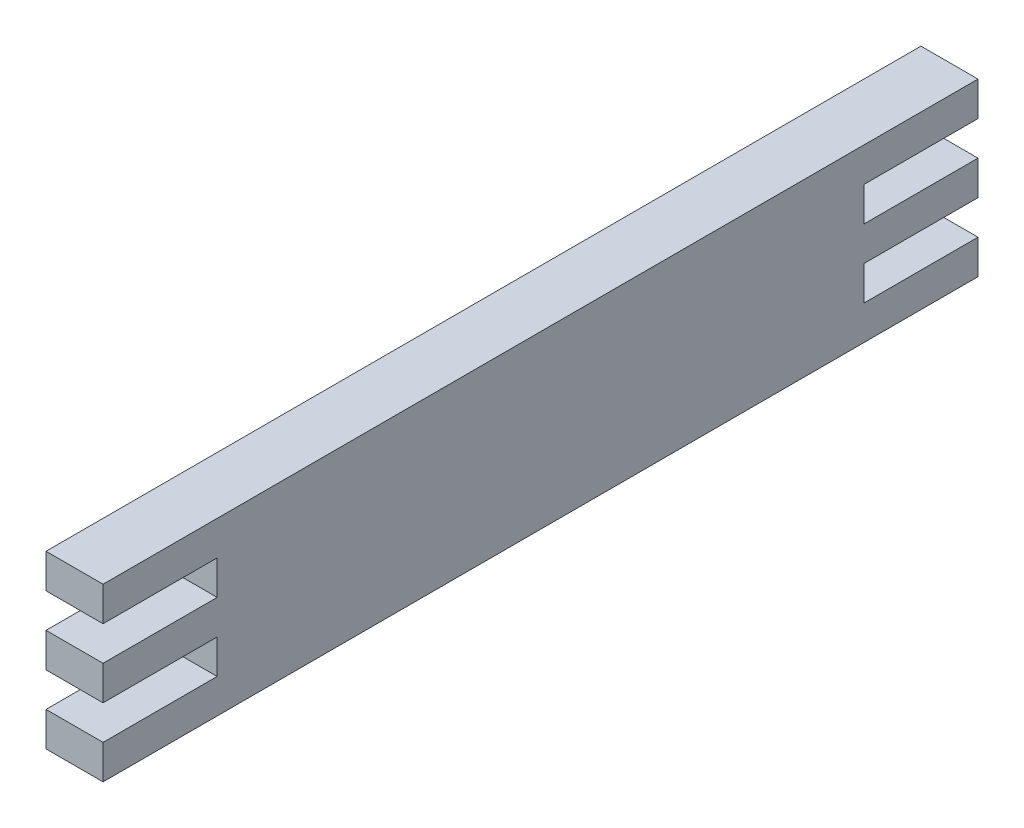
ISO-10303-21;
HEADER;
FILE_DESCRIPTION(('STEP AP214'),'2;1');
FILE_NAME('part.step','',(''),(''),'','','');
FILE_SCHEMA(('AUTOMOTIVE_DESIGN { 1 0 10303 214 1 1 1 1 }'));
ENDSEC;
DATA;
#1=APPLICATION_CONTEXT('core data for automotive mechanical design processes');
#2=APPLICATION_PROTOCOL_DEFINITION('international standard','automotive_design',2000,#1);
#3=PRODUCT_CONTEXT('',#1,'mechanical');
#4=PRODUCT('Part','Part','',(#3));
#5=PRODUCT_RELATED_PRODUCT_CATEGORY('part','',(#4));
#6=PRODUCT_DEFINITION_FORMATION('','',#4);
#7=PRODUCT_DEFINITION_CONTEXT('part definition',#1,'design');
#8=PRODUCT_DEFINITION('design','',#6,#7);
#9=PRODUCT_DEFINITION_SHAPE('','',#8);
#10=(LENGTH_UNIT() NAMED_UNIT(*) SI_UNIT(.MILLI.,.METRE.));
#11=(NAMED_UNIT(*) PLANE_ANGLE_UNIT() SI_UNIT($,.RADIAN.));
#12=(NAMED_UNIT(*) SI_UNIT($,.STERADIAN.) SOLID_ANGLE_UNIT());
#13=UNCERTAINTY_MEASURE_WITH_UNIT(LENGTH_MEASURE(1.E-05),#10,'distance_accuracy_value','');
#14=(GEOMETRIC_REPRESENTATION_CONTEXT(3) GLOBAL_UNCERTAINTY_ASSIGNED_CONTEXT((#13)) GLOBAL_UNIT_ASSIGNED_CONTEXT((#10,
#11,#12)) REPRESENTATION_CONTEXT('',''));
#15=CARTESIAN_POINT('',(0.,0.,0.));
#16=DIRECTION('',(0.,0.,1.));
#17=DIRECTION('',(1.,0.,0.));
#18=AXIS2_PLACEMENT_3D('',#15,#16,#17);
#19=CARTESIAN_POINT('',(3.,-4.5,-23.));
#20=DIRECTION('',(0.,0.,1.));
#21=DIRECTION('',(1.,0.,0.));
#22=AXIS2_PLACEMENT_3D('',#19,#20,#21);
#23=PLANE('',#22);
#24=DIRECTION('',(0.,1.,0.));
#25=VECTOR('',#24,1.);
#26=CARTESIAN_POINT('',(0.,-4.5,-23.));
#27=LINE('',#26,#25);
#28=CARTESIAN_POINT('',(0.,-0.9,-23.));
#29=VERTEX_POINT('',#28);
#30=CARTESIAN_POINT('',(0.,0.9,-23.));
#31=VERTEX_POINT('',#30);
#32=EDGE_CURVE('E216',#29,#31,#27,.T.);
#33=ORIENTED_EDGE('',*,*,#32,.T.);
#34=DIRECTION('',(1.,0.,0.));
#35=VECTOR('',#34,1.);
#36=CARTESIAN_POINT('',(-7.,0.9,-23.));
#37=LINE('',#36,#35);
#38=CARTESIAN_POINT('',(3.,0.9,-23.));
#39=VERTEX_POINT('',#38);
#40=EDGE_CURVE('E317',#31,#39,#37,.T.);
#41=ORIENTED_EDGE('',*,*,#40,.T.);
#42=DIRECTION('',(0.,1.,0.));
#43=VECTOR('',#42,1.);
#44=CARTESIAN_POINT('',(3.,-4.5,-23.));
#45=LINE('',#44,#43);
#46=CARTESIAN_POINT('',(3.,-0.9,-23.));
#47=VERTEX_POINT('',#46);
#48=EDGE_CURVE('E190',#47,#39,#45,.T.);
#49=ORIENTED_EDGE('',*,*,#48,.F.);
#50=DIRECTION('',(1.,0.,0.));
#51=VECTOR('',#50,1.);
#52=CARTESIAN_POINT('',(-7.,-0.9,-23.));
#53=LINE('',#52,#51);
#54=EDGE_CURVE('E308',#29,#47,#53,.T.);
#55=ORIENTED_EDGE('',*,*,#54,.F.);
#56=EDGE_LOOP('',(#33,#41,#49,#55));
#57=FACE_BOUND('',#56,.T.);
#58=ADVANCED_FACE('F31',(#57),#23,.F.);
#59=CARTESIAN_POINT('',(3.,2.7,-23.));
#60=VERTEX_POINT('',#59);
#61=CARTESIAN_POINT('',(3.,4.5,-23.));
#62=VERTEX_POINT('',#61);
#63=EDGE_CURVE('E180',#60,#62,#45,.T.);
#64=ORIENTED_EDGE('',*,*,#63,.F.);
#65=DIRECTION('',(1.,0.,0.));
#66=VECTOR('',#65,1.);
#67=CARTESIAN_POINT('',(-7.,2.7,-23.));
#68=LINE('',#67,#66);
#69=CARTESIAN_POINT('',(0.,2.7,-23.));
#70=VERTEX_POINT('',#69);
#71=EDGE_CURVE('E165',#70,#60,#68,.T.);
#72=ORIENTED_EDGE('',*,*,#71,.F.);
#73=CARTESIAN_POINT('',(0.,4.5,-23.));
#74=VERTEX_POINT('',#73);
#75=EDGE_CURVE('E217',#70,#74,#27,.T.);
#76=ORIENTED_EDGE('',*,*,#75,.T.);
#77=DIRECTION('',(-1.,0.,0.));
#78=VECTOR('',#77,1.);
#79=CARTESIAN_POINT('',(3.,4.5,-23.));
#80=LINE('',#79,#78);
#81=EDGE_CURVE('E189',#62,#74,#80,.T.);
#82=ORIENTED_EDGE('',*,*,#81,.F.);
#83=EDGE_LOOP('',(#64,#72,#76,#82));
#84=FACE_BOUND('',#83,.T.);
#85=ADVANCED_FACE('F187',(#84),#23,.F.);
#86=CARTESIAN_POINT('',(3.,-4.5,23.));
#87=DIRECTION('',(0.,0.,-1.));
#88=DIRECTION('',(-1.,0.,0.));
#89=AXIS2_PLACEMENT_3D('',#86,#87,#88);
#90=PLANE('',#89);
#91=DIRECTION('',(0.,-1.,0.));
#92=VECTOR('',#91,1.);
#93=CARTESIAN_POINT('',(3.,-4.5,23.));
#94=LINE('',#93,#92);
#95=CARTESIAN_POINT('',(3.,-2.7,23.));
#96=VERTEX_POINT('',#95);
#97=CARTESIAN_POINT('',(3.,-4.5,23.));
#98=VERTEX_POINT('',#97);
#99=EDGE_CURVE('E202',#96,#98,#94,.T.);
#100=ORIENTED_EDGE('',*,*,#99,.F.);
#101=DIRECTION('',(1.,0.,0.));
#102=VECTOR('',#101,1.);
#103=CARTESIAN_POINT('',(-7.,-2.7,23.));
#104=LINE('',#103,#102);
#105=CARTESIAN_POINT('',(0.,-2.7,23.));
#106=VERTEX_POINT('',#105);
#107=EDGE_CURVE('E293',#106,#96,#104,.T.);
#108=ORIENTED_EDGE('',*,*,#107,.F.);
#109=DIRECTION('',(0.,-1.,0.));
#110=VECTOR('',#109,1.);
#111=CARTESIAN_POINT('',(0.,-4.5,23.));
#112=LINE('',#111,#110);
#113=CARTESIAN_POINT('',(0.,-4.5,23.));
#114=VERTEX_POINT('',#113);
#115=EDGE_CURVE('E219',#106,#114,#112,.T.);
#116=ORIENTED_EDGE('',*,*,#115,.T.);
#117=DIRECTION('',(-1.,0.,0.));
#118=VECTOR('',#117,1.);
#119=CARTESIAN_POINT('',(3.,-4.5,23.));
#120=LINE('',#119,#118);
#121=EDGE_CURVE('E225',#98,#114,#120,.T.);
#122=ORIENTED_EDGE('',*,*,#121,.F.);
#123=EDGE_LOOP('',(#100,#108,#116,#122));
#124=FACE_BOUND('',#123,.T.);
#125=ADVANCED_FACE('F386',(#124),#90,.F.);
#126=CARTESIAN_POINT('',(0.,0.9,23.));
#127=VERTEX_POINT('',#126);
#128=CARTESIAN_POINT('',(0.,-0.900000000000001,23.));
#129=VERTEX_POINT('',#128);
#130=EDGE_CURVE('E221',#127,#129,#112,.T.);
#131=ORIENTED_EDGE('',*,*,#130,.T.);
#132=DIRECTION('',(1.,0.,0.));
#133=VECTOR('',#132,1.);
#134=CARTESIAN_POINT('',(-7.,-0.900000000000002,23.));
#135=LINE('',#134,#133);
#136=CARTESIAN_POINT('',(3.,-0.900000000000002,23.));
#137=VERTEX_POINT('',#136);
#138=EDGE_CURVE('E289',#129,#137,#135,.T.);
#139=ORIENTED_EDGE('',*,*,#138,.T.);
#140=CARTESIAN_POINT('',(3.,0.9,23.));
#141=VERTEX_POINT('',#140);
#142=EDGE_CURVE('E205',#141,#137,#94,.T.);
#143=ORIENTED_EDGE('',*,*,#142,.F.);
#144=DIRECTION('',(1.,0.,0.));
#145=VECTOR('',#144,1.);
#146=CARTESIAN_POINT('',(-7.,0.9,23.));
#147=LINE('',#146,#145);
#148=EDGE_CURVE('E262',#127,#141,#147,.T.);
#149=ORIENTED_EDGE('',*,*,#148,.F.);
#150=EDGE_LOOP('',(#131,#139,#143,#149));
#151=FACE_BOUND('',#150,.T.);
#152=ADVANCED_FACE('F358',(#151),#90,.F.);
#153=CARTESIAN_POINT('',(0.,-4.5,-23.));
#154=VERTEX_POINT('',#153);
#155=CARTESIAN_POINT('',(0.,-2.7,-23.));
#156=VERTEX_POINT('',#155);
#157=EDGE_CURVE('E212',#154,#156,#27,.T.);
#158=ORIENTED_EDGE('',*,*,#157,.T.);
#159=DIRECTION('',(1.,0.,0.));
#160=VECTOR('',#159,1.);
#161=CARTESIAN_POINT('',(-7.,-2.7,-23.));
#162=LINE('',#161,#160);
#163=CARTESIAN_POINT('',(3.,-2.7,-23.));
#164=VERTEX_POINT('',#163);
#165=EDGE_CURVE('E54',#156,#164,#162,.T.);
#166=ORIENTED_EDGE('',*,*,#165,.T.);
#167=CARTESIAN_POINT('',(3.,-4.5,-23.));
#168=VERTEX_POINT('',#167);
#169=EDGE_CURVE('E193',#168,#164,#45,.T.);
#170=ORIENTED_EDGE('',*,*,#169,.F.);
#171=DIRECTION('',(-1.,0.,0.));
#172=VECTOR('',#171,1.);
#173=CARTESIAN_POINT('',(3.,-4.5,-23.));
#174=LINE('',#173,#172);
#175=EDGE_CURVE('E211',#168,#154,#174,.T.);
#176=ORIENTED_EDGE('',*,*,#175,.T.);
#177=EDGE_LOOP('',(#158,#166,#170,#176));
#178=FACE_BOUND('',#177,.T.);
#179=ADVANCED_FACE('F33',(#178),#23,.F.);
#180=CARTESIAN_POINT('',(3.,4.5,23.));
#181=DIRECTION('',(0.,-1.,0.));
#182=DIRECTION('',(0.,0.,-1.));
#183=AXIS2_PLACEMENT_3D('',#180,#181,#182);
#184=PLANE('',#183);
#185=DIRECTION('',(0.,0.,1.));
#186=VECTOR('',#185,1.);
#187=CARTESIAN_POINT('',(0.,4.5,23.));
#188=LINE('',#187,#186);
#189=CARTESIAN_POINT('',(0.,4.5,23.));
#190=VERTEX_POINT('',#189);
#191=EDGE_CURVE('E215',#74,#190,#188,.T.);
#192=ORIENTED_EDGE('',*,*,#191,.T.);
#193=DIRECTION('',(-1.,0.,0.));
#194=VECTOR('',#193,1.);
#195=CARTESIAN_POINT('',(3.,4.5,23.));
#196=LINE('',#195,#194);
#197=CARTESIAN_POINT('',(3.,4.5,23.));
#198=VERTEX_POINT('',#197);
#199=EDGE_CURVE('E228',#198,#190,#196,.T.);
#200=ORIENTED_EDGE('',*,*,#199,.F.);
#201=DIRECTION('',(0.,0.,1.));
#202=VECTOR('',#201,1.);
#203=CARTESIAN_POINT('',(3.,4.5,23.));
#204=LINE('',#203,#202);
#205=EDGE_CURVE('E199',#62,#198,#204,.T.);
#206=ORIENTED_EDGE('',*,*,#205,.F.);
#207=ORIENTED_EDGE('',*,*,#81,.T.);
#208=EDGE_LOOP('',(#192,#200,#206,#207));
#209=FACE_BOUND('',#208,.T.);
#210=ADVANCED_FACE('F379',(#209),#184,.F.);
#211=CARTESIAN_POINT('',(0.,2.7,23.));
#212=VERTEX_POINT('',#211);
#213=EDGE_CURVE('E194',#190,#212,#112,.T.);
#214=ORIENTED_EDGE('',*,*,#213,.T.);
#215=DIRECTION('',(1.,0.,0.));
#216=VECTOR('',#215,1.);
#217=CARTESIAN_POINT('',(-7.,2.7,23.));
#218=LINE('',#217,#216);
#219=CARTESIAN_POINT('',(3.,2.7,23.));
#220=VERTEX_POINT('',#219);
#221=EDGE_CURVE('E268',#212,#220,#218,.T.);
#222=ORIENTED_EDGE('',*,*,#221,.T.);
#223=EDGE_CURVE('E207',#198,#220,#94,.T.);
#224=ORIENTED_EDGE('',*,*,#223,.F.);
#225=ORIENTED_EDGE('',*,*,#199,.T.);
#226=EDGE_LOOP('',(#214,#222,#224,#225));
#227=FACE_BOUND('',#226,.T.);
#228=ADVANCED_FACE('F376',(#227),#90,.F.);
#229=CARTESIAN_POINT('',(3.,-4.5,23.));
#230=DIRECTION('',(0.,1.,0.));
#231=DIRECTION('',(0.,0.,1.));
#232=AXIS2_PLACEMENT_3D('',#229,#230,#231);
#233=PLANE('',#232);
#234=DIRECTION('',(0.,0.,-1.));
#235=VECTOR('',#234,1.);
#236=CARTESIAN_POINT('',(0.,-4.5,23.));
#237=LINE('',#236,#235);
#238=EDGE_CURVE('E191',#114,#154,#237,.T.);
#239=ORIENTED_EDGE('',*,*,#238,.T.);
#240=ORIENTED_EDGE('',*,*,#175,.F.);
#241=DIRECTION('',(0.,0.,-1.));
#242=VECTOR('',#241,1.);
#243=CARTESIAN_POINT('',(3.,-4.5,23.));
#244=LINE('',#243,#242);
#245=EDGE_CURVE('E209',#98,#168,#244,.T.);
#246=ORIENTED_EDGE('',*,*,#245,.F.);
#247=ORIENTED_EDGE('',*,*,#121,.T.);
#248=EDGE_LOOP('',(#239,#240,#246,#247));
#249=FACE_BOUND('',#248,.T.);
#250=ADVANCED_FACE('F347',(#249),#233,.F.);
#251=CARTESIAN_POINT('',(3.,4.5,-23.));
#252=DIRECTION('',(-1.,0.,0.));
#253=DIRECTION('',(0.,0.,1.));
#254=AXIS2_PLACEMENT_3D('',#251,#252,#253);
#255=PLANE('',#254);
#256=ORIENTED_EDGE('',*,*,#48,.T.);
#257=DIRECTION('',(0.,0.,-1.));
#258=VECTOR('',#257,1.);
#259=CARTESIAN_POINT('',(3.,0.9,-23.));
#260=LINE('',#259,#258);
#261=CARTESIAN_POINT('',(3.,0.9,-17.));
#262=VERTEX_POINT('',#261);
#263=EDGE_CURVE('E175',#262,#39,#260,.T.);
#264=ORIENTED_EDGE('',*,*,#263,.F.);
#265=DIRECTION('',(0.,-1.,0.));
#266=VECTOR('',#265,1.);
#267=CARTESIAN_POINT('',(3.,0.9,-17.));
#268=LINE('',#267,#266);
#269=CARTESIAN_POINT('',(3.,2.7,-17.));
#270=VERTEX_POINT('',#269);
#271=EDGE_CURVE('E184',#270,#262,#268,.T.);
#272=ORIENTED_EDGE('',*,*,#271,.F.);
#273=DIRECTION('',(0.,0.,1.));
#274=VECTOR('',#273,1.);
#275=CARTESIAN_POINT('',(3.,2.7,-23.));
#276=LINE('',#275,#274);
#277=EDGE_CURVE('E168',#60,#270,#276,.T.);
#278=ORIENTED_EDGE('',*,*,#277,.F.);
#279=ORIENTED_EDGE('',*,*,#63,.T.);
#280=ORIENTED_EDGE('',*,*,#205,.T.);
#281=ORIENTED_EDGE('',*,*,#223,.T.);
#282=DIRECTION('',(0.,0.,1.));
#283=VECTOR('',#282,1.);
#284=CARTESIAN_POINT('',(3.,2.7,17.));
#285=LINE('',#284,#283);
#286=CARTESIAN_POINT('',(3.,2.7,17.));
#287=VERTEX_POINT('',#286);
#288=EDGE_CURVE('E278',#287,#220,#285,.T.);
#289=ORIENTED_EDGE('',*,*,#288,.F.);
#290=DIRECTION('',(0.,1.,0.));
#291=VECTOR('',#290,1.);
#292=CARTESIAN_POINT('',(3.,2.7,17.));
#293=LINE('',#292,#291);
#294=CARTESIAN_POINT('',(3.,0.9,17.));
#295=VERTEX_POINT('',#294);
#296=EDGE_CURVE('E282',#295,#287,#293,.T.);
#297=ORIENTED_EDGE('',*,*,#296,.F.);
#298=DIRECTION('',(0.,0.,-1.));
#299=VECTOR('',#298,1.);
#300=CARTESIAN_POINT('',(3.,0.9,17.));
#301=LINE('',#300,#299);
#302=EDGE_CURVE('E271',#141,#295,#301,.T.);
#303=ORIENTED_EDGE('',*,*,#302,.F.);
#304=ORIENTED_EDGE('',*,*,#142,.T.);
#305=DIRECTION('',(0.,0.,1.));
#306=VECTOR('',#305,1.);
#307=CARTESIAN_POINT('',(3.,-0.900000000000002,17.));
#308=LINE('',#307,#306);
#309=CARTESIAN_POINT('',(3.,-0.900000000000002,17.));
#310=VERTEX_POINT('',#309);
#311=EDGE_CURVE('E298',#310,#137,#308,.T.);
#312=ORIENTED_EDGE('',*,*,#311,.F.);
#313=DIRECTION('',(0.,1.,0.));
#314=VECTOR('',#313,1.);
#315=CARTESIAN_POINT('',(3.,-0.900000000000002,17.));
#316=LINE('',#315,#314);
#317=CARTESIAN_POINT('',(3.,-2.7,17.));
#318=VERTEX_POINT('',#317);
#319=EDGE_CURVE('E300',#318,#310,#316,.T.);
#320=ORIENTED_EDGE('',*,*,#319,.F.);
#321=DIRECTION('',(0.,0.,-1.));
#322=VECTOR('',#321,1.);
#323=CARTESIAN_POINT('',(3.,-2.7,17.));
#324=LINE('',#323,#322);
#325=EDGE_CURVE('E290',#96,#318,#324,.T.);
#326=ORIENTED_EDGE('',*,*,#325,.F.);
#327=ORIENTED_EDGE('',*,*,#99,.T.);
#328=ORIENTED_EDGE('',*,*,#245,.T.);
#329=ORIENTED_EDGE('',*,*,#169,.T.);
#330=DIRECTION('',(0.,0.,-1.));
#331=VECTOR('',#330,1.);
#332=CARTESIAN_POINT('',(3.,-2.7,-17.));
#333=LINE('',#332,#331);
#334=CARTESIAN_POINT('',(3.,-2.7,-17.));
#335=VERTEX_POINT('',#334);
#336=EDGE_CURVE('E313',#335,#164,#333,.T.);
#337=ORIENTED_EDGE('',*,*,#336,.F.);
#338=DIRECTION('',(0.,-1.,0.));
#339=VECTOR('',#338,1.);
#340=CARTESIAN_POINT('',(3.,-0.9,-17.));
#341=LINE('',#340,#339);
#342=CARTESIAN_POINT('',(3.,-0.9,-17.));
#343=VERTEX_POINT('',#342);
#344=EDGE_CURVE('E315',#343,#335,#341,.T.);
#345=ORIENTED_EDGE('',*,*,#344,.F.);
#346=DIRECTION('',(0.,0.,1.));
#347=VECTOR('',#346,1.);
#348=CARTESIAN_POINT('',(3.,-0.9,-17.));
#349=LINE('',#348,#347);
#350=EDGE_CURVE('E306',#47,#343,#349,.T.);
#351=ORIENTED_EDGE('',*,*,#350,.F.);
#352=EDGE_LOOP('',(#256,#264,#272,#278,#279,#280,#281,#289,#297,#303,#304,#312,#320,#326,#327,
#328,#329,#337,#345,#351));
#353=FACE_BOUND('',#352,.T.);
#354=ADVANCED_FACE('F179',(#353),#255,.F.);
#355=CARTESIAN_POINT('',(0.,4.5,-23.));
#356=DIRECTION('',(-1.,0.,0.));
#357=DIRECTION('',(0.,0.,1.));
#358=AXIS2_PLACEMENT_3D('',#355,#356,#357);
#359=PLANE('',#358);
#360=DIRECTION('',(0.,0.,1.));
#361=VECTOR('',#360,1.);
#362=CARTESIAN_POINT('',(0.,0.9,-23.));
#363=LINE('',#362,#361);
#364=CARTESIAN_POINT('',(0.,0.9,-17.));
#365=VERTEX_POINT('',#364);
#366=EDGE_CURVE('E11',#31,#365,#363,.T.);
#367=ORIENTED_EDGE('',*,*,#366,.F.);
#368=ORIENTED_EDGE('',*,*,#32,.F.);
#369=DIRECTION('',(0.,0.,-1.));
#370=VECTOR('',#369,1.);
#371=CARTESIAN_POINT('',(0.,-0.9,-23.));
#372=LINE('',#371,#370);
#373=CARTESIAN_POINT('',(0.,-0.9,-17.));
#374=VERTEX_POINT('',#373);
#375=EDGE_CURVE('E248',#374,#29,#372,.T.);
#376=ORIENTED_EDGE('',*,*,#375,.F.);
#377=DIRECTION('',(0.,1.,0.));
#378=VECTOR('',#377,1.);
#379=CARTESIAN_POINT('',(0.,4.5,-17.));
#380=LINE('',#379,#378);
#381=CARTESIAN_POINT('',(0.,-2.7,-17.));
#382=VERTEX_POINT('',#381);
#383=EDGE_CURVE('E246',#382,#374,#380,.T.);
#384=ORIENTED_EDGE('',*,*,#383,.F.);
#385=DIRECTION('',(0.,0.,1.));
#386=VECTOR('',#385,1.);
#387=CARTESIAN_POINT('',(0.,-2.7,-23.));
#388=LINE('',#387,#386);
#389=EDGE_CURVE('E244',#156,#382,#388,.T.);
#390=ORIENTED_EDGE('',*,*,#389,.F.);
#391=ORIENTED_EDGE('',*,*,#157,.F.);
#392=ORIENTED_EDGE('',*,*,#238,.F.);
#393=ORIENTED_EDGE('',*,*,#115,.F.);
#394=DIRECTION('',(0.,0.,1.));
#395=VECTOR('',#394,1.);
#396=CARTESIAN_POINT('',(0.,-2.7,-23.));
#397=LINE('',#396,#395);
#398=CARTESIAN_POINT('',(0.,-2.7,17.));
#399=VERTEX_POINT('',#398);
#400=EDGE_CURVE('E242',#399,#106,#397,.T.);
#401=ORIENTED_EDGE('',*,*,#400,.F.);
#402=DIRECTION('',(0.,-1.,0.));
#403=VECTOR('',#402,1.);
#404=CARTESIAN_POINT('',(0.,4.5,17.));
#405=LINE('',#404,#403);
#406=CARTESIAN_POINT('',(0.,-0.900000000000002,17.));
#407=VERTEX_POINT('',#406);
#408=EDGE_CURVE('E240',#407,#399,#405,.T.);
#409=ORIENTED_EDGE('',*,*,#408,.F.);
#410=DIRECTION('',(0.,0.,-1.));
#411=VECTOR('',#410,1.);
#412=CARTESIAN_POINT('',(0.,-0.900000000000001,-23.));
#413=LINE('',#412,#411);
#414=EDGE_CURVE('E238',#129,#407,#413,.T.);
#415=ORIENTED_EDGE('',*,*,#414,.F.);
#416=ORIENTED_EDGE('',*,*,#130,.F.);
#417=DIRECTION('',(0.,0.,1.));
#418=VECTOR('',#417,1.);
#419=CARTESIAN_POINT('',(0.,0.9,-23.));
#420=LINE('',#419,#418);
#421=CARTESIAN_POINT('',(0.,0.9,17.));
#422=VERTEX_POINT('',#421);
#423=EDGE_CURVE('E236',#422,#127,#420,.T.);
#424=ORIENTED_EDGE('',*,*,#423,.F.);
#425=DIRECTION('',(0.,-1.,0.));
#426=VECTOR('',#425,1.);
#427=CARTESIAN_POINT('',(0.,4.5,17.));
#428=LINE('',#427,#426);
#429=CARTESIAN_POINT('',(0.,2.7,17.));
#430=VERTEX_POINT('',#429);
#431=EDGE_CURVE('E234',#430,#422,#428,.T.);
#432=ORIENTED_EDGE('',*,*,#431,.F.);
#433=DIRECTION('',(0.,0.,-1.));
#434=VECTOR('',#433,1.);
#435=CARTESIAN_POINT('',(0.,2.7,-23.));
#436=LINE('',#435,#434);
#437=EDGE_CURVE('E232',#212,#430,#436,.T.);
#438=ORIENTED_EDGE('',*,*,#437,.F.);
#439=ORIENTED_EDGE('',*,*,#213,.F.);
#440=ORIENTED_EDGE('',*,*,#191,.F.);
#441=ORIENTED_EDGE('',*,*,#75,.F.);
#442=DIRECTION('',(0.,0.,-1.));
#443=VECTOR('',#442,1.);
#444=CARTESIAN_POINT('',(0.,2.7,-23.));
#445=LINE('',#444,#443);
#446=CARTESIAN_POINT('',(0.,2.7,-17.));
#447=VERTEX_POINT('',#446);
#448=EDGE_CURVE('E171',#447,#70,#445,.T.);
#449=ORIENTED_EDGE('',*,*,#448,.F.);
#450=DIRECTION('',(0.,1.,0.));
#451=VECTOR('',#450,1.);
#452=CARTESIAN_POINT('',(0.,4.5,-17.));
#453=LINE('',#452,#451);
#454=EDGE_CURVE('E39',#365,#447,#453,.T.);
#455=ORIENTED_EDGE('',*,*,#454,.F.);
#456=EDGE_LOOP('',(#367,#368,#376,#384,#390,#391,#392,#393,#401,#409,#415,#416,#424,#432,#438,
#439,#440,#441,#449,#455));
#457=FACE_BOUND('',#456,.T.);
#458=ADVANCED_FACE('F257',(#457),#359,.T.);
#459=CARTESIAN_POINT('',(-7.,2.7,17.));
#460=DIRECTION('',(0.,0.,-1.));
#461=DIRECTION('',(-1.,0.,0.));
#462=AXIS2_PLACEMENT_3D('',#459,#460,#461);
#463=PLANE('',#462);
#464=ORIENTED_EDGE('',*,*,#431,.T.);
#465=DIRECTION('',(1.,0.,0.));
#466=VECTOR('',#465,1.);
#467=CARTESIAN_POINT('',(-7.,0.9,17.));
#468=LINE('',#467,#466);
#469=EDGE_CURVE('E260',#422,#295,#468,.T.);
#470=ORIENTED_EDGE('',*,*,#469,.T.);
#471=ORIENTED_EDGE('',*,*,#296,.T.);
#472=DIRECTION('',(1.,0.,0.));
#473=VECTOR('',#472,1.);
#474=CARTESIAN_POINT('',(-7.,2.7,17.));
#475=LINE('',#474,#473);
#476=EDGE_CURVE('E275',#430,#287,#475,.T.);
#477=ORIENTED_EDGE('',*,*,#476,.F.);
#478=EDGE_LOOP('',(#464,#470,#471,#477));
#479=FACE_BOUND('',#478,.T.);
#480=ADVANCED_FACE('F373',(#479),#463,.F.);
#481=CARTESIAN_POINT('',(-7.,0.9,17.));
#482=DIRECTION('',(0.,-1.,0.));
#483=DIRECTION('',(0.,0.,-1.));
#484=AXIS2_PLACEMENT_3D('',#481,#482,#483);
#485=PLANE('',#484);
#486=ORIENTED_EDGE('',*,*,#423,.T.);
#487=ORIENTED_EDGE('',*,*,#148,.T.);
#488=ORIENTED_EDGE('',*,*,#302,.T.);
#489=ORIENTED_EDGE('',*,*,#469,.F.);
#490=EDGE_LOOP('',(#486,#487,#488,#489));
#491=FACE_BOUND('',#490,.T.);
#492=ADVANCED_FACE('F407',(#491),#485,.F.);
#493=CARTESIAN_POINT('',(-7.,2.7,17.));
#494=DIRECTION('',(0.,1.,0.));
#495=DIRECTION('',(0.,0.,1.));
#496=AXIS2_PLACEMENT_3D('',#493,#494,#495);
#497=PLANE('',#496);
#498=ORIENTED_EDGE('',*,*,#437,.T.);
#499=ORIENTED_EDGE('',*,*,#476,.T.);
#500=ORIENTED_EDGE('',*,*,#288,.T.);
#501=ORIENTED_EDGE('',*,*,#221,.F.);
#502=EDGE_LOOP('',(#498,#499,#500,#501));
#503=FACE_BOUND('',#502,.T.);
#504=ADVANCED_FACE('F408',(#503),#497,.F.);
#505=CARTESIAN_POINT('',(-7.,-0.900000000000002,17.));
#506=DIRECTION('',(0.,0.,-1.));
#507=DIRECTION('',(-1.,0.,0.));
#508=AXIS2_PLACEMENT_3D('',#505,#506,#507);
#509=PLANE('',#508);
#510=ORIENTED_EDGE('',*,*,#408,.T.);
#511=DIRECTION('',(1.,0.,0.));
#512=VECTOR('',#511,1.);
#513=CARTESIAN_POINT('',(-7.,-2.7,17.));
#514=LINE('',#513,#512);
#515=EDGE_CURVE('E284',#399,#318,#514,.T.);
#516=ORIENTED_EDGE('',*,*,#515,.T.);
#517=ORIENTED_EDGE('',*,*,#319,.T.);
#518=DIRECTION('',(1.,0.,0.));
#519=VECTOR('',#518,1.);
#520=CARTESIAN_POINT('',(-7.,-0.900000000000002,17.));
#521=LINE('',#520,#519);
#522=EDGE_CURVE('E287',#407,#310,#521,.T.);
#523=ORIENTED_EDGE('',*,*,#522,.F.);
#524=EDGE_LOOP('',(#510,#516,#517,#523));
#525=FACE_BOUND('',#524,.T.);
#526=ADVANCED_FACE('F368',(#525),#509,.F.);
#527=CARTESIAN_POINT('',(-7.,-2.7,17.));
#528=DIRECTION('',(0.,-1.,0.));
#529=DIRECTION('',(0.,0.,-1.));
#530=AXIS2_PLACEMENT_3D('',#527,#528,#529);
#531=PLANE('',#530);
#532=ORIENTED_EDGE('',*,*,#400,.T.);
#533=ORIENTED_EDGE('',*,*,#107,.T.);
#534=ORIENTED_EDGE('',*,*,#325,.T.);
#535=ORIENTED_EDGE('',*,*,#515,.F.);
#536=EDGE_LOOP('',(#532,#533,#534,#535));
#537=FACE_BOUND('',#536,.T.);
#538=ADVANCED_FACE('F415',(#537),#531,.F.);
#539=CARTESIAN_POINT('',(-7.,-0.900000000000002,17.));
#540=DIRECTION('',(0.,1.,0.));
#541=DIRECTION('',(0.,0.,1.));
#542=AXIS2_PLACEMENT_3D('',#539,#540,#541);
#543=PLANE('',#542);
#544=ORIENTED_EDGE('',*,*,#414,.T.);
#545=ORIENTED_EDGE('',*,*,#522,.T.);
#546=ORIENTED_EDGE('',*,*,#311,.T.);
#547=ORIENTED_EDGE('',*,*,#138,.F.);
#548=EDGE_LOOP('',(#544,#545,#546,#547));
#549=FACE_BOUND('',#548,.T.);
#550=ADVANCED_FACE('F366',(#549),#543,.F.);
#551=CARTESIAN_POINT('',(-7.,-0.9,-17.));
#552=DIRECTION('',(0.,0.,1.));
#553=DIRECTION('',(1.,0.,0.));
#554=AXIS2_PLACEMENT_3D('',#551,#552,#553);
#555=PLANE('',#554);
#556=ORIENTED_EDGE('',*,*,#383,.T.);
#557=DIRECTION('',(1.,0.,0.));
#558=VECTOR('',#557,1.);
#559=CARTESIAN_POINT('',(-7.,-0.9,-17.));
#560=LINE('',#559,#558);
#561=EDGE_CURVE('E303',#374,#343,#560,.T.);
#562=ORIENTED_EDGE('',*,*,#561,.T.);
#563=ORIENTED_EDGE('',*,*,#344,.T.);
#564=DIRECTION('',(1.,0.,0.));
#565=VECTOR('',#564,1.);
#566=CARTESIAN_POINT('',(-7.,-2.7,-17.));
#567=LINE('',#566,#565);
#568=EDGE_CURVE('E304',#382,#335,#567,.T.);
#569=ORIENTED_EDGE('',*,*,#568,.F.);
#570=EDGE_LOOP('',(#556,#562,#563,#569));
#571=FACE_BOUND('',#570,.T.);
#572=ADVANCED_FACE('F338',(#571),#555,.F.);
#573=CARTESIAN_POINT('',(-7.,-0.9,-17.));
#574=DIRECTION('',(0.,1.,0.));
#575=DIRECTION('',(0.,0.,1.));
#576=AXIS2_PLACEMENT_3D('',#573,#574,#575);
#577=PLANE('',#576);
#578=ORIENTED_EDGE('',*,*,#375,.T.);
#579=ORIENTED_EDGE('',*,*,#54,.T.);
#580=ORIENTED_EDGE('',*,*,#350,.T.);
#581=ORIENTED_EDGE('',*,*,#561,.F.);
#582=EDGE_LOOP('',(#578,#579,#580,#581));
#583=FACE_BOUND('',#582,.T.);
#584=ADVANCED_FACE('F335',(#583),#577,.F.);
#585=CARTESIAN_POINT('',(-7.,-2.7,-17.));
#586=DIRECTION('',(0.,-1.,0.));
#587=DIRECTION('',(0.,0.,-1.));
#588=AXIS2_PLACEMENT_3D('',#585,#586,#587);
#589=PLANE('',#588);
#590=ORIENTED_EDGE('',*,*,#389,.T.);
#591=ORIENTED_EDGE('',*,*,#568,.T.);
#592=ORIENTED_EDGE('',*,*,#336,.T.);
#593=ORIENTED_EDGE('',*,*,#165,.F.);
#594=EDGE_LOOP('',(#590,#591,#592,#593));
#595=FACE_BOUND('',#594,.T.);
#596=ADVANCED_FACE('F340',(#595),#589,.F.);
#597=CARTESIAN_POINT('',(-7.,0.9,-23.));
#598=DIRECTION('',(0.,-1.,0.));
#599=DIRECTION('',(0.,0.,-1.));
#600=AXIS2_PLACEMENT_3D('',#597,#598,#599);
#601=PLANE('',#600);
#602=ORIENTED_EDGE('',*,*,#366,.T.);
#603=DIRECTION('',(1.,0.,0.));
#604=VECTOR('',#603,1.);
#605=CARTESIAN_POINT('',(-7.,0.9,-17.));
#606=LINE('',#605,#604);
#607=EDGE_CURVE('E254',#365,#262,#606,.T.);
#608=ORIENTED_EDGE('',*,*,#607,.T.);
#609=ORIENTED_EDGE('',*,*,#263,.T.);
#610=ORIENTED_EDGE('',*,*,#40,.F.);
#611=EDGE_LOOP('',(#602,#608,#609,#610));
#612=FACE_BOUND('',#611,.T.);
#613=ADVANCED_FACE('F327',(#612),#601,.F.);
#614=CARTESIAN_POINT('',(-7.,0.9,-17.));
#615=DIRECTION('',(0.,0.,1.));
#616=DIRECTION('',(1.,0.,0.));
#617=AXIS2_PLACEMENT_3D('',#614,#615,#616);
#618=PLANE('',#617);
#619=ORIENTED_EDGE('',*,*,#454,.T.);
#620=DIRECTION('',(1.,0.,0.));
#621=VECTOR('',#620,1.);
#622=CARTESIAN_POINT('',(-7.,2.7,-17.));
#623=LINE('',#622,#621);
#624=EDGE_CURVE('E46',#447,#270,#623,.T.);
#625=ORIENTED_EDGE('',*,*,#624,.T.);
#626=ORIENTED_EDGE('',*,*,#271,.T.);
#627=ORIENTED_EDGE('',*,*,#607,.F.);
#628=EDGE_LOOP('',(#619,#625,#626,#627));
#629=FACE_BOUND('',#628,.T.);
#630=ADVANCED_FACE('F253',(#629),#618,.F.);
#631=CARTESIAN_POINT('',(-7.,2.7,-23.));
#632=DIRECTION('',(0.,1.,0.));
#633=DIRECTION('',(0.,0.,1.));
#634=AXIS2_PLACEMENT_3D('',#631,#632,#633);
#635=PLANE('',#634);
#636=ORIENTED_EDGE('',*,*,#448,.T.);
#637=ORIENTED_EDGE('',*,*,#71,.T.);
#638=ORIENTED_EDGE('',*,*,#277,.T.);
#639=ORIENTED_EDGE('',*,*,#624,.F.);
#640=EDGE_LOOP('',(#636,#637,#638,#639));
#641=FACE_BOUND('',#640,.T.);
#642=ADVANCED_FACE('F167',(#641),#635,.F.);
#643=CLOSED_SHELL('',(#58,#85,#125,#152,#179,#210,#228,#250,#354,#458,#480,#492,#504,#526,#538,
#550,#572,#584,#596,#613,#630,#642));
#644=MANIFOLD_SOLID_BREP('B2',#643);
#645=ADVANCED_BREP_SHAPE_REPRESENTATION('',(#18,#644),#14);
#646=SHAPE_DEFINITION_REPRESENTATION(#9,#645);
ENDSEC;
END-ISO-10303-21;
